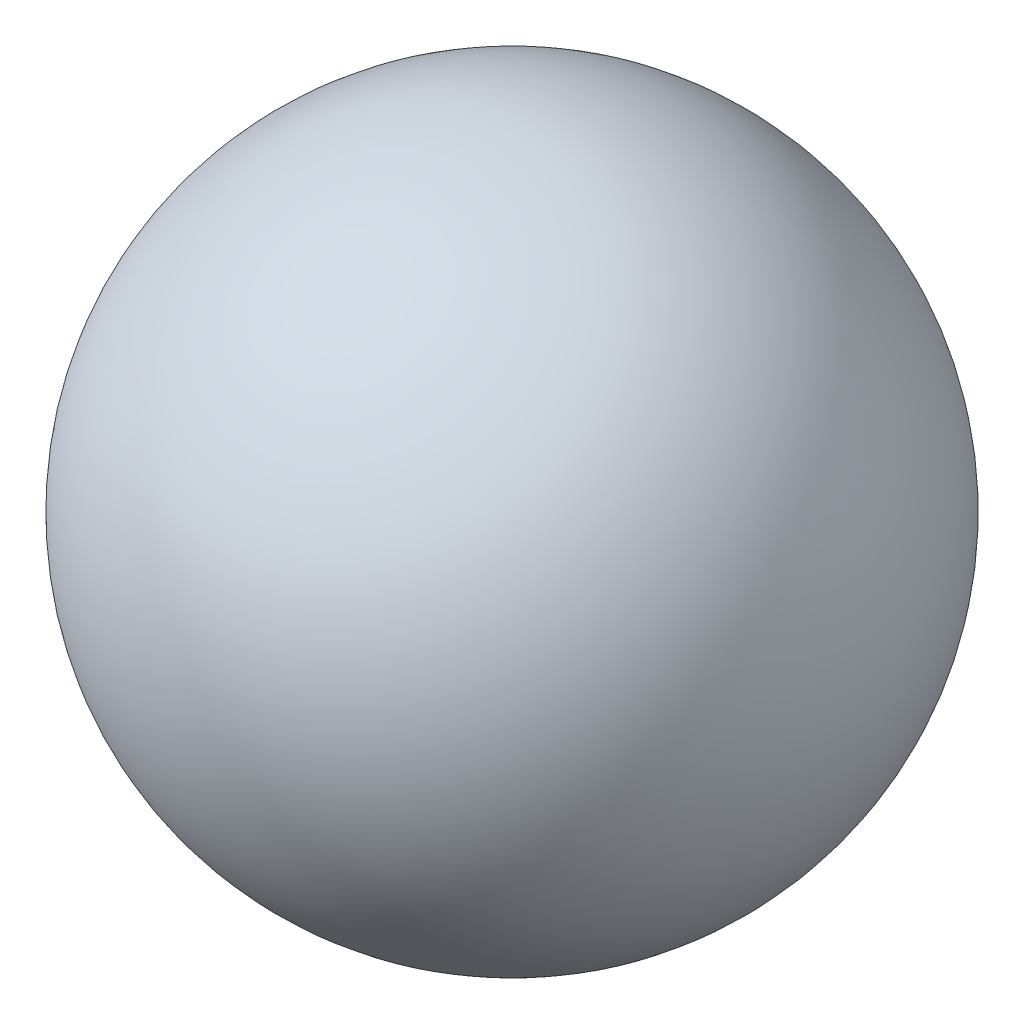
ISO-10303-21;
HEADER;
FILE_DESCRIPTION(('STEP AP214'),'2;1');
FILE_NAME('part.step','',(''),(''),'','','');
FILE_SCHEMA(('AUTOMOTIVE_DESIGN { 1 0 10303 214 1 1 1 1 }'));
ENDSEC;
DATA;
#1=APPLICATION_CONTEXT('core data for automotive mechanical design processes');
#2=APPLICATION_PROTOCOL_DEFINITION('international standard','automotive_design',2000,#1);
#3=PRODUCT_CONTEXT('',#1,'mechanical');
#4=PRODUCT('Part','Part','',(#3));
#5=PRODUCT_RELATED_PRODUCT_CATEGORY('part','',(#4));
#6=PRODUCT_DEFINITION_FORMATION('','',#4);
#7=PRODUCT_DEFINITION_CONTEXT('part definition',#1,'design');
#8=PRODUCT_DEFINITION('design','',#6,#7);
#9=PRODUCT_DEFINITION_SHAPE('','',#8);
#10=(LENGTH_UNIT() NAMED_UNIT(*) SI_UNIT(.MILLI.,.METRE.));
#11=(NAMED_UNIT(*) PLANE_ANGLE_UNIT() SI_UNIT($,.RADIAN.));
#12=(NAMED_UNIT(*) SI_UNIT($,.STERADIAN.) SOLID_ANGLE_UNIT());
#13=UNCERTAINTY_MEASURE_WITH_UNIT(LENGTH_MEASURE(1.E-05),#10,'distance_accuracy_value','');
#14=(GEOMETRIC_REPRESENTATION_CONTEXT(3) GLOBAL_UNCERTAINTY_ASSIGNED_CONTEXT((#13)) GLOBAL_UNIT_ASSIGNED_CONTEXT((#10,
#11,#12)) REPRESENTATION_CONTEXT('',''));
#15=CARTESIAN_POINT('',(0.,0.,0.));
#16=DIRECTION('',(0.,0.,1.));
#17=DIRECTION('',(1.,0.,0.));
#18=AXIS2_PLACEMENT_3D('',#15,#16,#17);
#19=CARTESIAN_POINT('',(0.,0.,0.));
#20=DIRECTION('',(0.,1.,0.));
#21=DIRECTION('',(1.,0.,0.));
#22=AXIS2_PLACEMENT_3D('',#19,#20,#21);
#23=SPHERICAL_SURFACE('',#22,2.6);
#24=CARTESIAN_POINT('',(0.,2.6,0.));
#25=VERTEX_POINT('',#24);
#26=VERTEX_LOOP('',#25);
#27=FACE_BOUND('',#26,.T.);
#28=ADVANCED_FACE('F352',(#27),#23,.T.);
#29=CLOSED_SHELL('',(#28));
#30=MANIFOLD_SOLID_BREP('B2',#29);
#31=ADVANCED_BREP_SHAPE_REPRESENTATION('',(#18,#30),#14);
#32=SHAPE_DEFINITION_REPRESENTATION(#9,#31);
ENDSEC;
END-ISO-10303-21;
